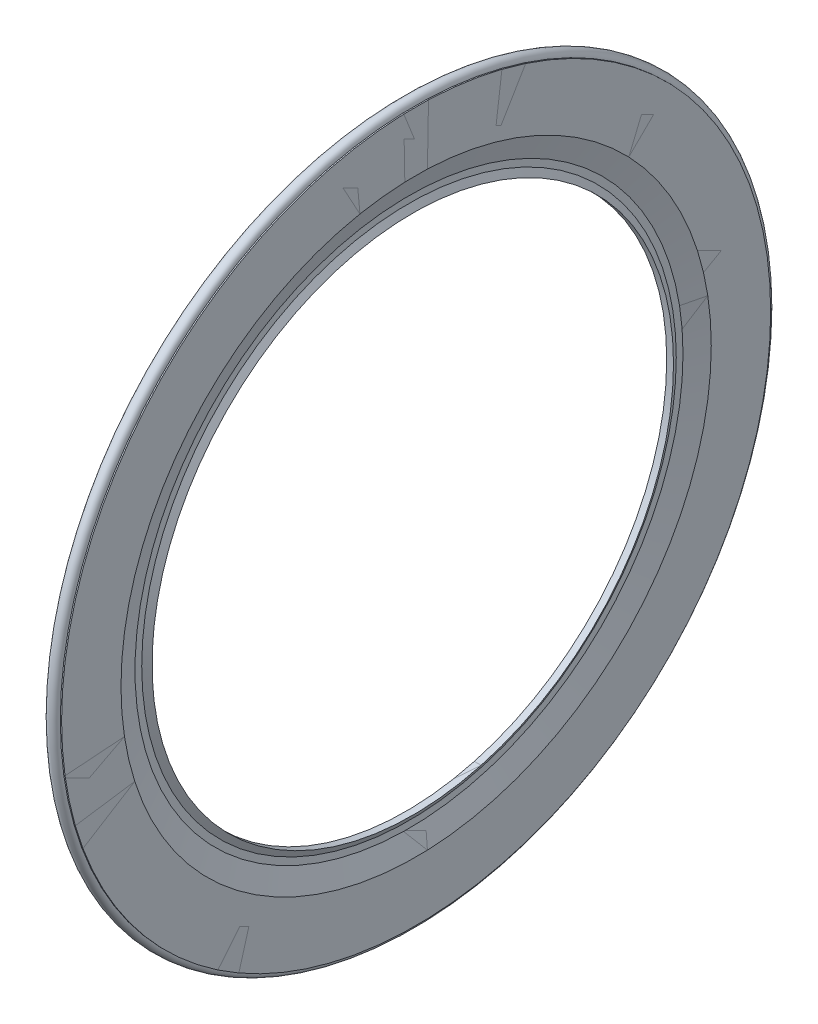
ISO-10303-21;
HEADER;
FILE_DESCRIPTION(('STEP AP214'),'2;1');
FILE_NAME('part.step','',(''),(''),'','','');
FILE_SCHEMA(('AUTOMOTIVE_DESIGN { 1 0 10303 214 1 1 1 1 }'));
ENDSEC;
DATA;
#1=APPLICATION_CONTEXT('core data for automotive mechanical design processes');
#2=APPLICATION_PROTOCOL_DEFINITION('international standard','automotive_design',2000,#1);
#3=PRODUCT_CONTEXT('',#1,'mechanical');
#4=PRODUCT('Part','Part','',(#3));
#5=PRODUCT_RELATED_PRODUCT_CATEGORY('part','',(#4));
#6=PRODUCT_DEFINITION_FORMATION('','',#4);
#7=PRODUCT_DEFINITION_CONTEXT('part definition',#1,'design');
#8=PRODUCT_DEFINITION('design','',#6,#7);
#9=PRODUCT_DEFINITION_SHAPE('','',#8);
#10=(LENGTH_UNIT() NAMED_UNIT(*) SI_UNIT(.MILLI.,.METRE.));
#11=(NAMED_UNIT(*) PLANE_ANGLE_UNIT() SI_UNIT($,.RADIAN.));
#12=(NAMED_UNIT(*) SI_UNIT($,.STERADIAN.) SOLID_ANGLE_UNIT());
#13=UNCERTAINTY_MEASURE_WITH_UNIT(LENGTH_MEASURE(1.E-05),#10,'distance_accuracy_value','');
#14=(GEOMETRIC_REPRESENTATION_CONTEXT(3) GLOBAL_UNCERTAINTY_ASSIGNED_CONTEXT((#13)) GLOBAL_UNIT_ASSIGNED_CONTEXT((#10,
#11,#12)) REPRESENTATION_CONTEXT('',''));
#15=CARTESIAN_POINT('',(0.,0.,0.));
#16=DIRECTION('',(0.,0.,1.));
#17=DIRECTION('',(1.,0.,0.));
#18=AXIS2_PLACEMENT_3D('',#15,#16,#17);
#19=CARTESIAN_POINT('',(12.8333333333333,0.,0.));
#20=DIRECTION('',(-1.,0.,0.));
#21=DIRECTION('',(0.,0.,1.));
#22=AXIS2_PLACEMENT_3D('',#19,#20,#21);
#23=CONICAL_SURFACE('',#22,21.1082905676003,1.0471975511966);
#24=CARTESIAN_POINT('',(13.061386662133,0.,0.));
#25=DIRECTION('',(1.,0.,0.));
#26=DIRECTION('',(0.,0.,-1.));
#27=AXIS2_PLACEMENT_3D('',#24,#25,#26);
#28=CIRCLE('',#27,20.7132906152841);
#29=CARTESIAN_POINT('',(13.061386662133,0.,-20.7132906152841));
#30=VERTEX_POINT('',#29);
#31=EDGE_CURVE('P0_E10',#30,#30,#28,.T.);
#32=ORIENTED_EDGE('',*,*,#31,.T.);
#33=EDGE_LOOP('',(#32));
#34=FACE_BOUND('',#33,.T.);
#35=CARTESIAN_POINT('',(12.8333333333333,0.,0.));
#36=DIRECTION('',(1.,0.,0.));
#37=DIRECTION('',(0.,0.,-1.));
#38=AXIS2_PLACEMENT_3D('',#35,#36,#37);
#39=CIRCLE('',#38,21.1082905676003);
#40=CARTESIAN_POINT('',(12.8333333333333,0.,-21.1082905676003));
#41=VERTEX_POINT('',#40);
#42=EDGE_CURVE('P0_E67',#41,#41,#39,.T.);
#43=ORIENTED_EDGE('',*,*,#42,.F.);
#44=EDGE_LOOP('',(#43));
#45=FACE_BOUND('',#44,.T.);
#46=ADVANCED_FACE('P0_F24',(#34,#45),#23,.F.);
#47=CARTESIAN_POINT('',(14.,0.,0.));
#48=DIRECTION('',(1.,0.,0.));
#49=DIRECTION('',(0.,0.,-1.));
#50=AXIS2_PLACEMENT_3D('',#47,#48,#49);
#51=CYLINDRICAL_SURFACE('',#50,20.7132906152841);
#52=CARTESIAN_POINT('',(13.6002469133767,0.,0.));
#53=DIRECTION('',(1.,0.,0.));
#54=DIRECTION('',(0.,0.,-1.));
#55=AXIS2_PLACEMENT_3D('',#52,#53,#54);
#56=CIRCLE('',#55,20.7132906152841);
#57=CARTESIAN_POINT('',(13.6002469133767,0.,-20.7132906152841));
#58=VERTEX_POINT('',#57);
#59=EDGE_CURVE('P0_E30',#58,#58,#56,.T.);
#60=ORIENTED_EDGE('',*,*,#59,.T.);
#61=EDGE_LOOP('',(#60));
#62=FACE_BOUND('',#61,.T.);
#63=ORIENTED_EDGE('',*,*,#31,.F.);
#64=EDGE_LOOP('',(#63));
#65=FACE_BOUND('',#64,.T.);
#66=ADVANCED_FACE('P0_F75',(#62,#65),#51,.F.);
#67=CARTESIAN_POINT('',(13.6002469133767,0.,0.));
#68=DIRECTION('',(-1.,0.,0.));
#69=DIRECTION('',(0.,0.,1.));
#70=AXIS2_PLACEMENT_3D('',#67,#68,#69);
#71=CONICAL_SURFACE('',#70,20.7132906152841,1.0471975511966);
#72=CARTESIAN_POINT('',(13.3,0.,0.));
#73=DIRECTION('',(1.,0.,0.));
#74=DIRECTION('',(0.,0.,-1.));
#75=AXIS2_PLACEMENT_3D('',#72,#73,#74);
#76=CIRCLE('',#75,21.2333335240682);
#77=CARTESIAN_POINT('',(13.3,0.,-21.2333335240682));
#78=VERTEX_POINT('',#77);
#79=EDGE_CURVE('P0_E34',#78,#78,#76,.T.);
#80=ORIENTED_EDGE('',*,*,#79,.T.);
#81=EDGE_LOOP('',(#80));
#82=FACE_BOUND('',#81,.T.);
#83=ORIENTED_EDGE('',*,*,#59,.F.);
#84=EDGE_LOOP('',(#83));
#85=FACE_BOUND('',#84,.T.);
#86=ADVANCED_FACE('P0_F79',(#82,#85),#71,.T.);
#87=CARTESIAN_POINT('',(13.3,21.2333335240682,0.));
#88=DIRECTION('',(1.,0.,0.));
#89=DIRECTION('',(0.,0.,-1.));
#90=AXIS2_PLACEMENT_3D('',#87,#88,#89);
#91=PLANE('',#90);
#92=CARTESIAN_POINT('',(13.3,0.,0.));
#93=DIRECTION('',(1.,0.,0.));
#94=DIRECTION('',(0.,0.,-1.));
#95=AXIS2_PLACEMENT_3D('',#92,#93,#94);
#96=CIRCLE('',#95,21.767313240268);
#97=CARTESIAN_POINT('',(13.3,0.,-21.767313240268));
#98=VERTEX_POINT('',#97);
#99=EDGE_CURVE('P0_E38',#98,#98,#96,.T.);
#100=ORIENTED_EDGE('',*,*,#99,.T.);
#101=EDGE_LOOP('',(#100));
#102=FACE_BOUND('',#101,.T.);
#103=ORIENTED_EDGE('',*,*,#79,.F.);
#104=EDGE_LOOP('',(#103));
#105=FACE_BOUND('',#104,.T.);
#106=ADVANCED_FACE('P0_F83',(#102,#105),#91,.T.);
#107=CARTESIAN_POINT('',(13.8666666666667,0.,0.));
#108=DIRECTION('',(1.,0.,0.));
#109=DIRECTION('',(0.,0.,-1.));
#110=AXIS2_PLACEMENT_3D('',#107,#108,#109);
#111=CONICAL_SURFACE('',#110,23.446063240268,1.24525312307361);
#112=ORIENTED_EDGE('',*,*,#99,.F.);
#113=EDGE_LOOP('',(#112));
#114=FACE_BOUND('',#113,.T.);
#115=CARTESIAN_POINT('',(13.8666666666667,0.,0.));
#116=DIRECTION('',(1.,0.,0.));
#117=DIRECTION('',(0.,0.,-1.));
#118=AXIS2_PLACEMENT_3D('',#115,#116,#117);
#119=CIRCLE('',#118,23.446063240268);
#120=CARTESIAN_POINT('',(13.8666666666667,0.,-23.446063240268));
#121=VERTEX_POINT('',#120);
#122=EDGE_CURVE('P0_E43',#121,#121,#119,.T.);
#123=ORIENTED_EDGE('',*,*,#122,.T.);
#124=EDGE_LOOP('',(#123));
#125=FACE_BOUND('',#124,.T.);
#126=ADVANCED_FACE('P0_F90',(#114,#125),#111,.F.);
#127=CARTESIAN_POINT('',(13.8666666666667,28.165285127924,0.));
#128=DIRECTION('',(-1.,0.,0.));
#129=DIRECTION('',(0.,0.,1.));
#130=AXIS2_PLACEMENT_3D('',#127,#128,#129);
#131=PLANE('',#130);
#132=ORIENTED_EDGE('',*,*,#122,.F.);
#133=EDGE_LOOP('',(#132));
#134=FACE_BOUND('',#133,.T.);
#135=CARTESIAN_POINT('',(13.8666666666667,0.,0.));
#136=DIRECTION('',(1.,0.,0.));
#137=DIRECTION('',(0.,0.,-1.));
#138=AXIS2_PLACEMENT_3D('',#135,#136,#137);
#139=CIRCLE('',#138,28.165285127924);
#140=CARTESIAN_POINT('',(13.8666666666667,0.,-28.165285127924));
#141=VERTEX_POINT('',#140);
#142=EDGE_CURVE('P0_E46',#141,#141,#139,.T.);
#143=ORIENTED_EDGE('',*,*,#142,.T.);
#144=EDGE_LOOP('',(#143));
#145=FACE_BOUND('',#144,.T.);
#146=ADVANCED_FACE('P0_F94',(#134,#145),#131,.F.);
#147=CARTESIAN_POINT('',(14.,0.,0.));
#148=DIRECTION('',(1.,0.,0.));
#149=DIRECTION('',(0.,0.,-1.));
#150=AXIS2_PLACEMENT_3D('',#147,#148,#149);
#151=CYLINDRICAL_SURFACE('',#150,28.165285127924);
#152=ORIENTED_EDGE('',*,*,#142,.F.);
#153=EDGE_LOOP('',(#152));
#154=FACE_BOUND('',#153,.T.);
#155=CARTESIAN_POINT('',(13.7666666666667,0.,0.));
#156=DIRECTION('',(1.,0.,0.));
#157=DIRECTION('',(0.,0.,-1.));
#158=AXIS2_PLACEMENT_3D('',#155,#156,#157);
#159=CIRCLE('',#158,28.165285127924);
#160=CARTESIAN_POINT('',(13.7666666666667,0.,-28.165285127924));
#161=VERTEX_POINT('',#160);
#162=EDGE_CURVE('P0_E49',#161,#161,#159,.T.);
#163=ORIENTED_EDGE('',*,*,#162,.T.);
#164=EDGE_LOOP('',(#163));
#165=FACE_BOUND('',#164,.T.);
#166=ADVANCED_FACE('P0_F98',(#154,#165),#151,.T.);
#167=CARTESIAN_POINT('',(13.3,0.,0.));
#168=DIRECTION('',(1.,0.,0.));
#169=DIRECTION('',(0.,0.,-1.));
#170=AXIS2_PLACEMENT_3D('',#167,#168,#169);
#171=TOROIDAL_SURFACE('',#170,28.165285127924,0.466666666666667);
#172=ORIENTED_EDGE('',*,*,#162,.F.);
#173=EDGE_LOOP('',(#172));
#174=FACE_BOUND('',#173,.T.);
#175=CARTESIAN_POINT('',(12.8333333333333,0.,0.));
#176=DIRECTION('',(1.,0.,0.));
#177=DIRECTION('',(0.,0.,-1.));
#178=AXIS2_PLACEMENT_3D('',#175,#176,#177);
#179=CIRCLE('',#178,28.165285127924);
#180=CARTESIAN_POINT('',(12.8333333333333,0.,-28.165285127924));
#181=VERTEX_POINT('',#180);
#182=EDGE_CURVE('P0_E52',#181,#181,#179,.T.);
#183=ORIENTED_EDGE('',*,*,#182,.T.);
#184=EDGE_LOOP('',(#183));
#185=FACE_BOUND('',#184,.T.);
#186=ADVANCED_FACE('P0_F102',(#174,#185),#171,.T.);
#187=CARTESIAN_POINT('',(12.8333333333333,28.165285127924,0.));
#188=DIRECTION('',(-1.,0.,0.));
#189=DIRECTION('',(0.,0.,1.));
#190=AXIS2_PLACEMENT_3D('',#187,#188,#189);
#191=PLANE('',#190);
#192=CARTESIAN_POINT('',(12.8333333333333,0.,0.));
#193=DIRECTION('',(1.,0.,0.));
#194=DIRECTION('',(0.,0.,-1.));
#195=AXIS2_PLACEMENT_3D('',#192,#193,#194);
#196=CIRCLE('',#195,26.32375);
#197=CARTESIAN_POINT('',(12.8333333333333,0.,-26.32375));
#198=VERTEX_POINT('',#197);
#199=EDGE_CURVE('P0_E55',#198,#198,#196,.T.);
#200=ORIENTED_EDGE('',*,*,#199,.T.);
#201=EDGE_LOOP('',(#200));
#202=FACE_BOUND('',#201,.T.);
#203=ORIENTED_EDGE('',*,*,#182,.F.);
#204=EDGE_LOOP('',(#203));
#205=FACE_BOUND('',#204,.T.);
#206=ADVANCED_FACE('P0_F106',(#202,#205),#191,.T.);
#207=CARTESIAN_POINT('',(12.9333333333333,0.,0.));
#208=DIRECTION('',(-1.,0.,0.));
#209=DIRECTION('',(0.,0.,1.));
#210=AXIS2_PLACEMENT_3D('',#207,#208,#209);
#211=CONICAL_SURFACE('',#210,26.0275,1.24525312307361);
#212=ORIENTED_EDGE('',*,*,#199,.F.);
#213=EDGE_LOOP('',(#212));
#214=FACE_BOUND('',#213,.T.);
#215=CARTESIAN_POINT('',(12.9333333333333,0.,0.));
#216=DIRECTION('',(1.,0.,0.));
#217=DIRECTION('',(0.,0.,-1.));
#218=AXIS2_PLACEMENT_3D('',#215,#216,#217);
#219=CIRCLE('',#218,26.0275);
#220=CARTESIAN_POINT('',(12.9333333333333,0.,-26.0275));
#221=VERTEX_POINT('',#220);
#222=EDGE_CURVE('P0_E58',#221,#221,#219,.T.);
#223=ORIENTED_EDGE('',*,*,#222,.T.);
#224=EDGE_LOOP('',(#223));
#225=FACE_BOUND('',#224,.T.);
#226=ADVANCED_FACE('P0_F110',(#214,#225),#211,.F.);
#227=CARTESIAN_POINT('',(12.9333333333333,22.4725,0.));
#228=DIRECTION('',(1.,0.,0.));
#229=DIRECTION('',(0.,0.,-1.));
#230=AXIS2_PLACEMENT_3D('',#227,#228,#229);
#231=PLANE('',#230);
#232=ORIENTED_EDGE('',*,*,#222,.F.);
#233=EDGE_LOOP('',(#232));
#234=FACE_BOUND('',#233,.T.);
#235=CARTESIAN_POINT('',(12.9333333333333,0.,0.));
#236=DIRECTION('',(1.,0.,0.));
#237=DIRECTION('',(0.,0.,-1.));
#238=AXIS2_PLACEMENT_3D('',#235,#236,#237);
#239=CIRCLE('',#238,22.4725);
#240=CARTESIAN_POINT('',(12.9333333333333,0.,-22.4725));
#241=VERTEX_POINT('',#240);
#242=EDGE_CURVE('P0_E61',#241,#241,#239,.T.);
#243=ORIENTED_EDGE('',*,*,#242,.T.);
#244=EDGE_LOOP('',(#243));
#245=FACE_BOUND('',#244,.T.);
#246=ADVANCED_FACE('P0_F114',(#234,#245),#231,.F.);
#247=CARTESIAN_POINT('',(12.8333333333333,0.,0.));
#248=DIRECTION('',(1.,0.,0.));
#249=DIRECTION('',(0.,0.,-1.));
#250=AXIS2_PLACEMENT_3D('',#247,#248,#249);
#251=CONICAL_SURFACE('',#250,22.17625,1.24525312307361);
#252=ORIENTED_EDGE('',*,*,#242,.F.);
#253=EDGE_LOOP('',(#252));
#254=FACE_BOUND('',#253,.T.);
#255=CARTESIAN_POINT('',(12.8333333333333,0.,0.));
#256=DIRECTION('',(1.,0.,0.));
#257=DIRECTION('',(0.,0.,-1.));
#258=AXIS2_PLACEMENT_3D('',#255,#256,#257);
#259=CIRCLE('',#258,22.17625);
#260=CARTESIAN_POINT('',(12.8333333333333,0.,-22.17625));
#261=VERTEX_POINT('',#260);
#262=EDGE_CURVE('P0_E64',#261,#261,#259,.T.);
#263=ORIENTED_EDGE('',*,*,#262,.T.);
#264=EDGE_LOOP('',(#263));
#265=FACE_BOUND('',#264,.T.);
#266=ADVANCED_FACE('P0_F118',(#254,#265),#251,.T.);
#267=CARTESIAN_POINT('',(12.8333333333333,22.17625,0.));
#268=DIRECTION('',(-1.,0.,0.));
#269=DIRECTION('',(0.,0.,1.));
#270=AXIS2_PLACEMENT_3D('',#267,#268,#269);
#271=PLANE('',#270);
#272=ORIENTED_EDGE('',*,*,#42,.T.);
#273=EDGE_LOOP('',(#272));
#274=FACE_BOUND('',#273,.T.);
#275=ORIENTED_EDGE('',*,*,#262,.F.);
#276=EDGE_LOOP('',(#275));
#277=FACE_BOUND('',#276,.T.);
#278=ADVANCED_FACE('P0_F71',(#274,#277),#271,.T.);
#279=CLOSED_SHELL('',(#46,#66,#86,#106,#126,#146,#166,#186,#206,#226,#246,#266,#278));
#280=MANIFOLD_SOLID_BREP('P0_B2',#279);
#281=CARTESIAN_POINT('',(12.8333333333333,0.,0.));
#282=DIRECTION('',(-1.,0.,0.));
#283=DIRECTION('',(0.,0.,1.));
#284=AXIS2_PLACEMENT_3D('',#281,#282,#283);
#285=CONICAL_SURFACE('',#284,21.1082905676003,1.0471975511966);
#286=CARTESIAN_POINT('',(13.061386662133,0.,0.));
#287=DIRECTION('',(1.,0.,0.));
#288=DIRECTION('',(0.,0.,-1.));
#289=AXIS2_PLACEMENT_3D('',#286,#287,#288);
#290=CIRCLE('',#289,20.7132906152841);
#291=CARTESIAN_POINT('',(13.061386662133,0.,-20.7132906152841));
#292=VERTEX_POINT('',#291);
#293=EDGE_CURVE('P1_E10',#292,#292,#290,.T.);
#294=ORIENTED_EDGE('',*,*,#293,.T.);
#295=EDGE_LOOP('',(#294));
#296=FACE_BOUND('',#295,.T.);
#297=CARTESIAN_POINT('',(12.8333333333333,0.,0.));
#298=DIRECTION('',(1.,0.,0.));
#299=DIRECTION('',(0.,0.,-1.));
#300=AXIS2_PLACEMENT_3D('',#297,#298,#299);
#301=CIRCLE('',#300,21.1082905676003);
#302=CARTESIAN_POINT('',(12.8333333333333,0.,-21.1082905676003));
#303=VERTEX_POINT('',#302);
#304=EDGE_CURVE('P1_E57',#303,#303,#301,.T.);
#305=ORIENTED_EDGE('',*,*,#304,.F.);
#306=EDGE_LOOP('',(#305));
#307=FACE_BOUND('',#306,.T.);
#308=ADVANCED_FACE('P1_F14',(#296,#307),#285,.F.);
#309=CARTESIAN_POINT('',(14.,0.,0.));
#310=DIRECTION('',(1.,0.,0.));
#311=DIRECTION('',(0.,0.,-1.));
#312=AXIS2_PLACEMENT_3D('',#309,#310,#311);
#313=CYLINDRICAL_SURFACE('',#312,20.7132906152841);
#314=CARTESIAN_POINT('',(13.6002469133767,0.,0.));
#315=DIRECTION('',(1.,0.,0.));
#316=DIRECTION('',(0.,0.,-1.));
#317=AXIS2_PLACEMENT_3D('',#314,#315,#316);
#318=CIRCLE('',#317,20.7132906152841);
#319=CARTESIAN_POINT('',(13.6002469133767,0.,-20.7132906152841));
#320=VERTEX_POINT('',#319);
#321=EDGE_CURVE('P1_E20',#320,#320,#318,.T.);
#322=ORIENTED_EDGE('',*,*,#321,.T.);
#323=EDGE_LOOP('',(#322));
#324=FACE_BOUND('',#323,.T.);
#325=ORIENTED_EDGE('',*,*,#293,.F.);
#326=EDGE_LOOP('',(#325));
#327=FACE_BOUND('',#326,.T.);
#328=ADVANCED_FACE('P1_F65',(#324,#327),#313,.F.);
#329=CARTESIAN_POINT('',(13.6002469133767,0.,0.));
#330=DIRECTION('',(-1.,0.,0.));
#331=DIRECTION('',(0.,0.,1.));
#332=AXIS2_PLACEMENT_3D('',#329,#330,#331);
#333=CONICAL_SURFACE('',#332,20.7132906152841,1.0471975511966);
#334=CARTESIAN_POINT('',(13.3,0.,0.));
#335=DIRECTION('',(1.,0.,0.));
#336=DIRECTION('',(0.,0.,-1.));
#337=AXIS2_PLACEMENT_3D('',#334,#335,#336);
#338=CIRCLE('',#337,21.2333335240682);
#339=CARTESIAN_POINT('',(13.3,0.,-21.2333335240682));
#340=VERTEX_POINT('',#339);
#341=EDGE_CURVE('P1_E24',#340,#340,#338,.T.);
#342=ORIENTED_EDGE('',*,*,#341,.T.);
#343=EDGE_LOOP('',(#342));
#344=FACE_BOUND('',#343,.T.);
#345=ORIENTED_EDGE('',*,*,#321,.F.);
#346=EDGE_LOOP('',(#345));
#347=FACE_BOUND('',#346,.T.);
#348=ADVANCED_FACE('P1_F70',(#344,#347),#333,.T.);
#349=CARTESIAN_POINT('',(13.3,21.2333335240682,0.));
#350=DIRECTION('',(1.,0.,0.));
#351=DIRECTION('',(0.,0.,-1.));
#352=AXIS2_PLACEMENT_3D('',#349,#350,#351);
#353=PLANE('',#352);
#354=CARTESIAN_POINT('',(13.3,0.,0.));
#355=DIRECTION('',(1.,0.,0.));
#356=DIRECTION('',(0.,0.,-1.));
#357=AXIS2_PLACEMENT_3D('',#354,#355,#356);
#358=CIRCLE('',#357,21.767313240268);
#359=CARTESIAN_POINT('',(13.3,0.,-21.767313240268));
#360=VERTEX_POINT('',#359);
#361=EDGE_CURVE('P1_E28',#360,#360,#358,.T.);
#362=ORIENTED_EDGE('',*,*,#361,.T.);
#363=EDGE_LOOP('',(#362));
#364=FACE_BOUND('',#363,.T.);
#365=ORIENTED_EDGE('',*,*,#341,.F.);
#366=EDGE_LOOP('',(#365));
#367=FACE_BOUND('',#366,.T.);
#368=ADVANCED_FACE('P1_F74',(#364,#367),#353,.T.);
#369=CARTESIAN_POINT('',(13.8666666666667,0.,0.));
#370=DIRECTION('',(1.,0.,0.));
#371=DIRECTION('',(0.,0.,-1.));
#372=AXIS2_PLACEMENT_3D('',#369,#370,#371);
#373=CONICAL_SURFACE('',#372,23.446063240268,1.24525312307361);
#374=ORIENTED_EDGE('',*,*,#361,.F.);
#375=EDGE_LOOP('',(#374));
#376=FACE_BOUND('',#375,.T.);
#377=CARTESIAN_POINT('',(13.8666666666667,0.,0.));
#378=DIRECTION('',(1.,0.,0.));
#379=DIRECTION('',(0.,0.,-1.));
#380=AXIS2_PLACEMENT_3D('',#377,#378,#379);
#381=CIRCLE('',#380,23.446063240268);
#382=CARTESIAN_POINT('',(13.8666666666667,0.,-23.446063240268));
#383=VERTEX_POINT('',#382);
#384=EDGE_CURVE('P1_E33',#383,#383,#381,.T.);
#385=ORIENTED_EDGE('',*,*,#384,.T.);
#386=EDGE_LOOP('',(#385));
#387=FACE_BOUND('',#386,.T.);
#388=ADVANCED_FACE('P1_F81',(#376,#387),#373,.F.);
#389=CARTESIAN_POINT('',(13.8666666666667,28.165285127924,0.));
#390=DIRECTION('',(-1.,0.,0.));
#391=DIRECTION('',(0.,0.,1.));
#392=AXIS2_PLACEMENT_3D('',#389,#390,#391);
#393=PLANE('',#392);
#394=ORIENTED_EDGE('',*,*,#384,.F.);
#395=EDGE_LOOP('',(#394));
#396=FACE_BOUND('',#395,.T.);
#397=CARTESIAN_POINT('',(13.8666666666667,0.,0.));
#398=DIRECTION('',(1.,0.,0.));
#399=DIRECTION('',(0.,0.,-1.));
#400=AXIS2_PLACEMENT_3D('',#397,#398,#399);
#401=CIRCLE('',#400,28.165285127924);
#402=CARTESIAN_POINT('',(13.8666666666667,0.,-28.165285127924));
#403=VERTEX_POINT('',#402);
#404=EDGE_CURVE('P1_E36',#403,#403,#401,.T.);
#405=ORIENTED_EDGE('',*,*,#404,.T.);
#406=EDGE_LOOP('',(#405));
#407=FACE_BOUND('',#406,.T.);
#408=ADVANCED_FACE('P1_F85',(#396,#407),#393,.F.);
#409=CARTESIAN_POINT('',(14.,0.,0.));
#410=DIRECTION('',(1.,0.,0.));
#411=DIRECTION('',(0.,0.,-1.));
#412=AXIS2_PLACEMENT_3D('',#409,#410,#411);
#413=CYLINDRICAL_SURFACE('',#412,28.165285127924);
#414=ORIENTED_EDGE('',*,*,#404,.F.);
#415=EDGE_LOOP('',(#414));
#416=FACE_BOUND('',#415,.T.);
#417=CARTESIAN_POINT('',(13.7666666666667,0.,0.));
#418=DIRECTION('',(1.,0.,0.));
#419=DIRECTION('',(0.,0.,-1.));
#420=AXIS2_PLACEMENT_3D('',#417,#418,#419);
#421=CIRCLE('',#420,28.165285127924);
#422=CARTESIAN_POINT('',(13.7666666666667,0.,-28.165285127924));
#423=VERTEX_POINT('',#422);
#424=EDGE_CURVE('P1_E39',#423,#423,#421,.T.);
#425=ORIENTED_EDGE('',*,*,#424,.T.);
#426=EDGE_LOOP('',(#425));
#427=FACE_BOUND('',#426,.T.);
#428=ADVANCED_FACE('P1_F89',(#416,#427),#413,.T.);
#429=CARTESIAN_POINT('',(13.3,0.,0.));
#430=DIRECTION('',(1.,0.,0.));
#431=DIRECTION('',(0.,0.,-1.));
#432=AXIS2_PLACEMENT_3D('',#429,#430,#431);
#433=TOROIDAL_SURFACE('',#432,28.165285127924,0.466666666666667);
#434=ORIENTED_EDGE('',*,*,#424,.F.);
#435=EDGE_LOOP('',(#434));
#436=FACE_BOUND('',#435,.T.);
#437=CARTESIAN_POINT('',(12.8333333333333,0.,0.));
#438=DIRECTION('',(1.,0.,0.));
#439=DIRECTION('',(0.,0.,-1.));
#440=AXIS2_PLACEMENT_3D('',#437,#438,#439);
#441=CIRCLE('',#440,28.165285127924);
#442=CARTESIAN_POINT('',(12.8333333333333,0.,-28.165285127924));
#443=VERTEX_POINT('',#442);
#444=EDGE_CURVE('P1_E42',#443,#443,#441,.T.);
#445=ORIENTED_EDGE('',*,*,#444,.T.);
#446=EDGE_LOOP('',(#445));
#447=FACE_BOUND('',#446,.T.);
#448=ADVANCED_FACE('P1_F93',(#436,#447),#433,.T.);
#449=CARTESIAN_POINT('',(12.8333333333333,28.165285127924,0.));
#450=DIRECTION('',(-1.,0.,0.));
#451=DIRECTION('',(0.,0.,1.));
#452=AXIS2_PLACEMENT_3D('',#449,#450,#451);
#453=PLANE('',#452);
#454=CARTESIAN_POINT('',(12.8333333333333,0.,0.));
#455=DIRECTION('',(1.,0.,0.));
#456=DIRECTION('',(0.,0.,-1.));
#457=AXIS2_PLACEMENT_3D('',#454,#455,#456);
#458=CIRCLE('',#457,26.32375);
#459=CARTESIAN_POINT('',(12.8333333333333,0.,-26.32375));
#460=VERTEX_POINT('',#459);
#461=EDGE_CURVE('P1_E45',#460,#460,#458,.T.);
#462=ORIENTED_EDGE('',*,*,#461,.T.);
#463=EDGE_LOOP('',(#462));
#464=FACE_BOUND('',#463,.T.);
#465=ORIENTED_EDGE('',*,*,#444,.F.);
#466=EDGE_LOOP('',(#465));
#467=FACE_BOUND('',#466,.T.);
#468=ADVANCED_FACE('P1_F97',(#464,#467),#453,.T.);
#469=CARTESIAN_POINT('',(12.9333333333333,0.,0.));
#470=DIRECTION('',(-1.,0.,0.));
#471=DIRECTION('',(0.,0.,1.));
#472=AXIS2_PLACEMENT_3D('',#469,#470,#471);
#473=CONICAL_SURFACE('',#472,26.0275,1.24525312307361);
#474=ORIENTED_EDGE('',*,*,#461,.F.);
#475=EDGE_LOOP('',(#474));
#476=FACE_BOUND('',#475,.T.);
#477=CARTESIAN_POINT('',(12.9333333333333,0.,0.));
#478=DIRECTION('',(1.,0.,0.));
#479=DIRECTION('',(0.,0.,-1.));
#480=AXIS2_PLACEMENT_3D('',#477,#478,#479);
#481=CIRCLE('',#480,26.0275);
#482=CARTESIAN_POINT('',(12.9333333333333,0.,-26.0275));
#483=VERTEX_POINT('',#482);
#484=EDGE_CURVE('P1_E48',#483,#483,#481,.T.);
#485=ORIENTED_EDGE('',*,*,#484,.T.);
#486=EDGE_LOOP('',(#485));
#487=FACE_BOUND('',#486,.T.);
#488=ADVANCED_FACE('P1_F101',(#476,#487),#473,.F.);
#489=CARTESIAN_POINT('',(12.9333333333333,22.4725,0.));
#490=DIRECTION('',(1.,0.,0.));
#491=DIRECTION('',(0.,0.,-1.));
#492=AXIS2_PLACEMENT_3D('',#489,#490,#491);
#493=PLANE('',#492);
#494=ORIENTED_EDGE('',*,*,#484,.F.);
#495=EDGE_LOOP('',(#494));
#496=FACE_BOUND('',#495,.T.);
#497=CARTESIAN_POINT('',(12.9333333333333,0.,0.));
#498=DIRECTION('',(1.,0.,0.));
#499=DIRECTION('',(0.,0.,-1.));
#500=AXIS2_PLACEMENT_3D('',#497,#498,#499);
#501=CIRCLE('',#500,22.4725);
#502=CARTESIAN_POINT('',(12.9333333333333,0.,-22.4725));
#503=VERTEX_POINT('',#502);
#504=EDGE_CURVE('P1_E51',#503,#503,#501,.T.);
#505=ORIENTED_EDGE('',*,*,#504,.T.);
#506=EDGE_LOOP('',(#505));
#507=FACE_BOUND('',#506,.T.);
#508=ADVANCED_FACE('P1_F105',(#496,#507),#493,.F.);
#509=CARTESIAN_POINT('',(12.8333333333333,0.,0.));
#510=DIRECTION('',(1.,0.,0.));
#511=DIRECTION('',(0.,0.,-1.));
#512=AXIS2_PLACEMENT_3D('',#509,#510,#511);
#513=CONICAL_SURFACE('',#512,22.17625,1.24525312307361);
#514=ORIENTED_EDGE('',*,*,#504,.F.);
#515=EDGE_LOOP('',(#514));
#516=FACE_BOUND('',#515,.T.);
#517=CARTESIAN_POINT('',(12.8333333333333,0.,0.));
#518=DIRECTION('',(1.,0.,0.));
#519=DIRECTION('',(0.,0.,-1.));
#520=AXIS2_PLACEMENT_3D('',#517,#518,#519);
#521=CIRCLE('',#520,22.17625);
#522=CARTESIAN_POINT('',(12.8333333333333,0.,-22.17625));
#523=VERTEX_POINT('',#522);
#524=EDGE_CURVE('P1_E54',#523,#523,#521,.T.);
#525=ORIENTED_EDGE('',*,*,#524,.T.);
#526=EDGE_LOOP('',(#525));
#527=FACE_BOUND('',#526,.T.);
#528=ADVANCED_FACE('P1_F109',(#516,#527),#513,.T.);
#529=CARTESIAN_POINT('',(12.8333333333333,22.17625,0.));
#530=DIRECTION('',(-1.,0.,0.));
#531=DIRECTION('',(0.,0.,1.));
#532=AXIS2_PLACEMENT_3D('',#529,#530,#531);
#533=PLANE('',#532);
#534=ORIENTED_EDGE('',*,*,#304,.T.);
#535=EDGE_LOOP('',(#534));
#536=FACE_BOUND('',#535,.T.);
#537=ORIENTED_EDGE('',*,*,#524,.F.);
#538=EDGE_LOOP('',(#537));
#539=FACE_BOUND('',#538,.T.);
#540=ADVANCED_FACE('P1_F61',(#536,#539),#533,.T.);
#541=CLOSED_SHELL('',(#308,#328,#348,#368,#388,#408,#428,#448,#468,#488,#508,#528,#540));
#542=MANIFOLD_SOLID_BREP('P1_B1',#541);
#543=ADVANCED_BREP_SHAPE_REPRESENTATION('',(#18,#280,#542),#14);
#544=SHAPE_DEFINITION_REPRESENTATION(#9,#543);
ENDSEC;
END-ISO-10303-21;
